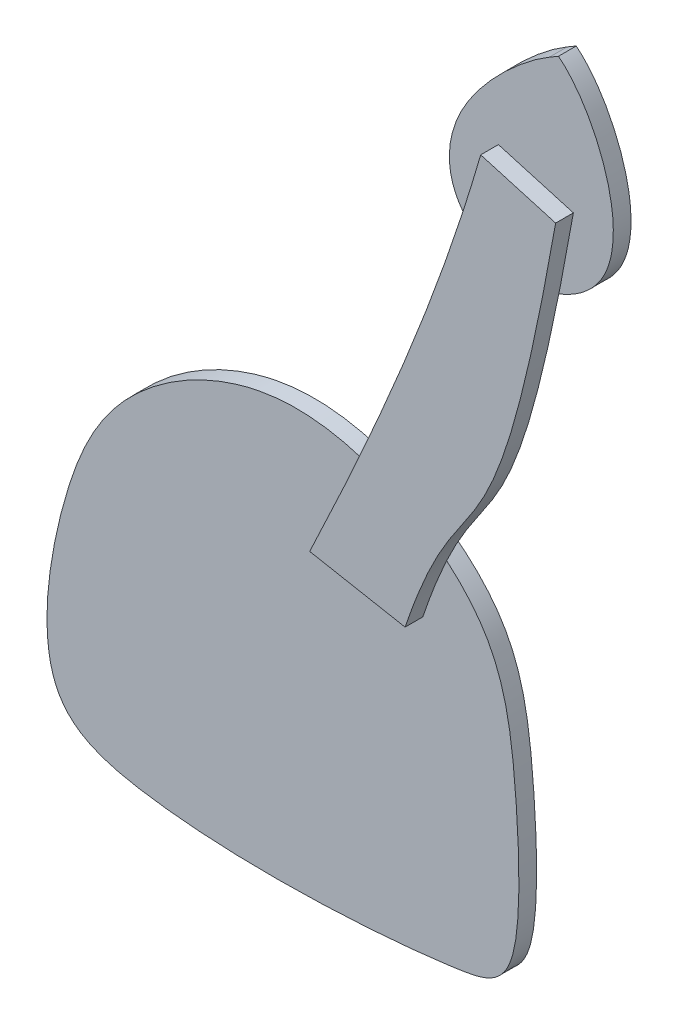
from build123d import *

# Parameters (mm, degrees)
SKETCH1_R             = 25.4
BOSS_EXTRUDE1_DEPTH   = 3.175
BOSS_EXTRUDE2_DEPTH   = 3.175
BOSS_EXTRUDE2_2_DEPTH = 3.175
BOSS_EXTRUDE3_START   = 3.175
BOSS_EXTRUDE3_DEPTH   = 3.175


with BuildPart() as part:
    # Sketch1 → Boss-Extrude1 (new body)
    with BuildSketch(Plane.XY):
        Circle(SKETCH1_R)
    extrude(amount=-BOSS_EXTRUDE1_DEPTH)


with BuildPart() as body_2:
    # Sketch1_3 → Boss-Extrude2 (new body)
    with BuildSketch(Plane.XY):
        with BuildLine():
            add(Edge.make_bspline(
                [(-4.511561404, 44.81610663), (-0.457142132, 45.594837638), (14.352706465, 45.926501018), (37.910508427, 32.198157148), (41.772703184, 8.42152067), (42.979639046, -24.76921553), (25.47906905, -28.631410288), (-17.970621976, -31.045282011), (-45.36806604, -22.476037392), (-40.754173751, 9.995455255), (-30.522754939, 33.043012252), (-14.13768621, 42.967219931), (-4.511561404, 44.81610663)],
                knots=[0, 0, 0, 0, 0.047837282, 0.173390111, 0.25589527, 0.33330674, 0.401840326, 0.611751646, 0.695454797, 0.803039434, 0.886423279, 1, 1, 1, 1], degree=3))
        make_face()
    extrude(amount=BOSS_EXTRUDE2_DEPTH)


with BuildPart() as body_3:
    # Sketch1_3 → Boss-Extrude2 2 (new body)
    with BuildSketch(Plane.XY):
        with BuildLine():
            Line((47.546972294, 122.59221742), (49.179999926, 123.548772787))
            add(Edge.make_bspline(
                [(47.546972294, 122.59221742), (42.898248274, 119.869200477), (29.707265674, 108.380537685), (28.721665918, 94.28250961), (35.956386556, 86.593837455), (46.15141824, 84.279724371), (65.550961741, 95.173028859), (55.841116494, 118.322283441), (49.179999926, 123.548772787)],
                knots=[0, 0, 0, 0, 0.205286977, 0.353401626, 0.407522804, 0.517432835, 0.647818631, 1, 1, 1, 1], degree=3))
        make_face()
    extrude(amount=BOSS_EXTRUDE2_2_DEPTH)


with BuildPart() as body_4:
    # Sketch1_4 → Boss-Extrude3 (new body)
    with BuildSketch(Plane.XY.offset(BOSS_EXTRUDE3_START)):
        with BuildLine():
            Line((38.421170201, 104.463785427), (51.8455102, 100.593941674))
            add(Edge.make_bspline(
                [(51.8455102, 100.593941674), (40.274937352, 35.195244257), (35.906328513, 57.065952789), (24.883217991, 24.447144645)],
                knots=[0, 0, 0, 0, 1, 1, 1, 1], degree=3))
            Line((24.883217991, 24.447144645), (7.802478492, 27.642949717))
            add(Edge.make_bspline(
                [(7.802478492, 27.642949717), (22.588776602, 58.542501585), (31.912275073, 81.884677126), (38.421170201, 104.463785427)],
                knots=[0, 0, 0, 0, 1, 1, 1, 1], degree=3))
        make_face()
    extrude(amount=BOSS_EXTRUDE3_DEPTH)


solid = Compound([part.part, body_2.part, body_3.part, body_4.part])
